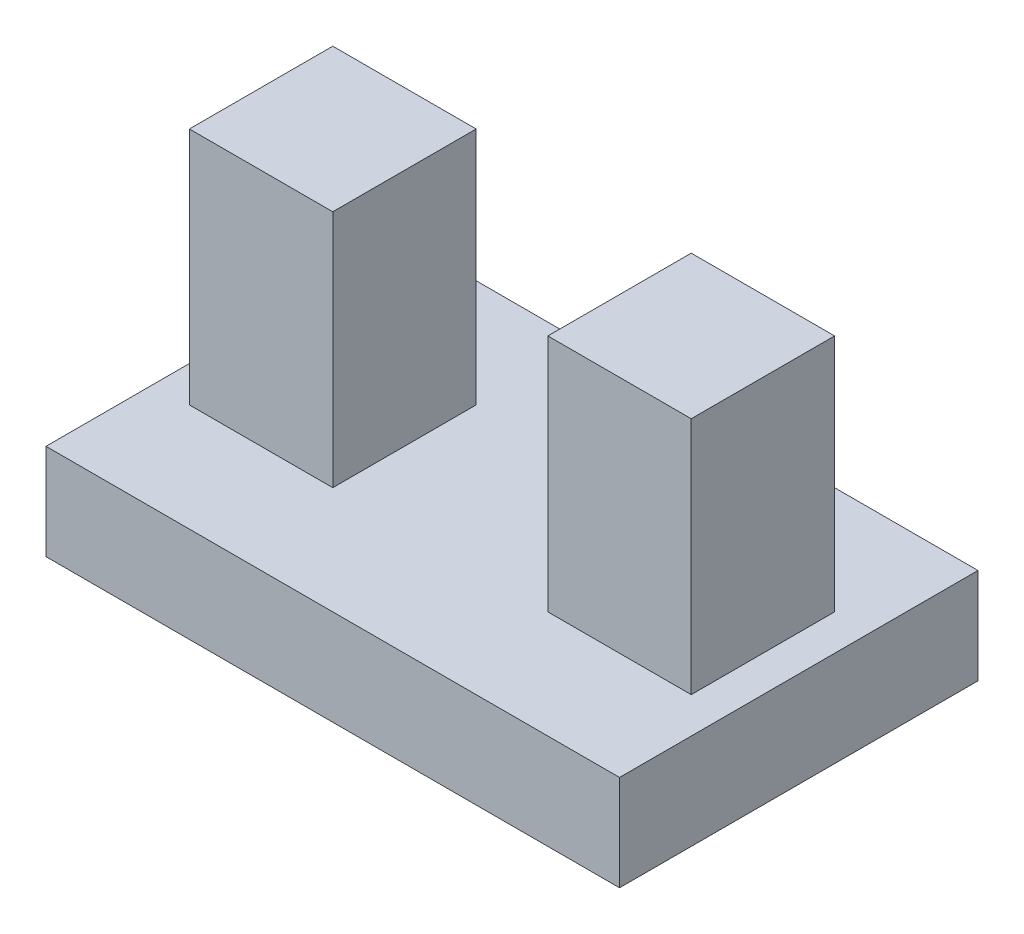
ISO-10303-21;
HEADER;
FILE_DESCRIPTION(('STEP AP214'),'2;1');
FILE_NAME('part.step','',(''),(''),'','','');
FILE_SCHEMA(('AUTOMOTIVE_DESIGN { 1 0 10303 214 1 1 1 1 }'));
ENDSEC;
DATA;
#1=APPLICATION_CONTEXT('core data for automotive mechanical design processes');
#2=APPLICATION_PROTOCOL_DEFINITION('international standard','automotive_design',2000,#1);
#3=PRODUCT_CONTEXT('',#1,'mechanical');
#4=PRODUCT('Part','Part','',(#3));
#5=PRODUCT_RELATED_PRODUCT_CATEGORY('part','',(#4));
#6=PRODUCT_DEFINITION_FORMATION('','',#4);
#7=PRODUCT_DEFINITION_CONTEXT('part definition',#1,'design');
#8=PRODUCT_DEFINITION('design','',#6,#7);
#9=PRODUCT_DEFINITION_SHAPE('','',#8);
#10=(LENGTH_UNIT() NAMED_UNIT(*) SI_UNIT(.MILLI.,.METRE.));
#11=(NAMED_UNIT(*) PLANE_ANGLE_UNIT() SI_UNIT($,.RADIAN.));
#12=(NAMED_UNIT(*) SI_UNIT($,.STERADIAN.) SOLID_ANGLE_UNIT());
#13=UNCERTAINTY_MEASURE_WITH_UNIT(LENGTH_MEASURE(1.E-05),#10,'distance_accuracy_value','');
#14=(GEOMETRIC_REPRESENTATION_CONTEXT(3) GLOBAL_UNCERTAINTY_ASSIGNED_CONTEXT((#13)) GLOBAL_UNIT_ASSIGNED_CONTEXT((#10,
#11,#12)) REPRESENTATION_CONTEXT('',''));
#15=CARTESIAN_POINT('',(0.,0.,0.));
#16=DIRECTION('',(0.,0.,1.));
#17=DIRECTION('',(1.,0.,0.));
#18=AXIS2_PLACEMENT_3D('',#15,#16,#17);
#19=CARTESIAN_POINT('',(0.,4.,0.));
#20=DIRECTION('',(0.,-1.,0.));
#21=DIRECTION('',(0.,0.,-1.));
#22=AXIS2_PLACEMENT_3D('',#19,#20,#21);
#23=PLANE('',#22);
#24=DIRECTION('',(0.,0.,1.));
#25=VECTOR('',#24,1.);
#26=CARTESIAN_POINT('',(-10.5,4.,-3.));
#27=LINE('',#26,#25);
#28=CARTESIAN_POINT('',(-10.5,4.,-3.));
#29=VERTEX_POINT('',#28);
#30=CARTESIAN_POINT('',(-10.5,4.,3.));
#31=VERTEX_POINT('',#30);
#32=EDGE_CURVE('E144',#29,#31,#27,.T.);
#33=ORIENTED_EDGE('',*,*,#32,.F.);
#34=DIRECTION('',(-1.,0.,0.));
#35=VECTOR('',#34,1.);
#36=CARTESIAN_POINT('',(-4.5,4.,-3.));
#37=LINE('',#36,#35);
#38=CARTESIAN_POINT('',(-4.5,4.,-3.));
#39=VERTEX_POINT('',#38);
#40=EDGE_CURVE('E157',#39,#29,#37,.T.);
#41=ORIENTED_EDGE('',*,*,#40,.F.);
#42=DIRECTION('',(0.,0.,-1.));
#43=VECTOR('',#42,1.);
#44=CARTESIAN_POINT('',(-4.5,4.,-3.));
#45=LINE('',#44,#43);
#46=CARTESIAN_POINT('',(-4.5,4.,3.));
#47=VERTEX_POINT('',#46);
#48=EDGE_CURVE('E166',#47,#39,#45,.T.);
#49=ORIENTED_EDGE('',*,*,#48,.F.);
#50=DIRECTION('',(1.,0.,0.));
#51=VECTOR('',#50,1.);
#52=CARTESIAN_POINT('',(-4.5,4.,3.));
#53=LINE('',#52,#51);
#54=EDGE_CURVE('E147',#31,#47,#53,.T.);
#55=ORIENTED_EDGE('',*,*,#54,.F.);
#56=EDGE_LOOP('',(#33,#41,#49,#55));
#57=FACE_BOUND('',#56,.T.);
#58=DIRECTION('',(0.,0.,1.));
#59=VECTOR('',#58,1.);
#60=CARTESIAN_POINT('',(-12.,4.,-7.5));
#61=LINE('',#60,#59);
#62=CARTESIAN_POINT('',(-12.,4.,-7.5));
#63=VERTEX_POINT('',#62);
#64=CARTESIAN_POINT('',(-12.,4.,7.5));
#65=VERTEX_POINT('',#64);
#66=EDGE_CURVE('E183',#63,#65,#61,.T.);
#67=ORIENTED_EDGE('',*,*,#66,.T.);
#68=DIRECTION('',(1.,0.,0.));
#69=VECTOR('',#68,1.);
#70=CARTESIAN_POINT('',(12.,4.,7.5));
#71=LINE('',#70,#69);
#72=CARTESIAN_POINT('',(12.,4.,7.5));
#73=VERTEX_POINT('',#72);
#74=EDGE_CURVE('E186',#65,#73,#71,.T.);
#75=ORIENTED_EDGE('',*,*,#74,.T.);
#76=DIRECTION('',(0.,0.,-1.));
#77=VECTOR('',#76,1.);
#78=CARTESIAN_POINT('',(12.,4.,-7.5));
#79=LINE('',#78,#77);
#80=CARTESIAN_POINT('',(12.,4.,-7.5));
#81=VERTEX_POINT('',#80);
#82=EDGE_CURVE('E189',#73,#81,#79,.T.);
#83=ORIENTED_EDGE('',*,*,#82,.T.);
#84=DIRECTION('',(-1.,0.,0.));
#85=VECTOR('',#84,1.);
#86=CARTESIAN_POINT('',(12.,4.,-7.5));
#87=LINE('',#86,#85);
#88=EDGE_CURVE('E191',#81,#63,#87,.T.);
#89=ORIENTED_EDGE('',*,*,#88,.T.);
#90=EDGE_LOOP('',(#67,#75,#83,#89));
#91=FACE_BOUND('',#90,.T.);
#92=DIRECTION('',(0.,0.,1.));
#93=VECTOR('',#92,1.);
#94=CARTESIAN_POINT('',(4.5,4.,-3.00000000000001));
#95=LINE('',#94,#93);
#96=CARTESIAN_POINT('',(4.5,4.,-3.00000000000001));
#97=VERTEX_POINT('',#96);
#98=CARTESIAN_POINT('',(4.5,4.,2.99999999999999));
#99=VERTEX_POINT('',#98);
#100=EDGE_CURVE('E143',#97,#99,#95,.T.);
#101=ORIENTED_EDGE('',*,*,#100,.F.);
#102=DIRECTION('',(-1.,0.,0.));
#103=VECTOR('',#102,1.);
#104=CARTESIAN_POINT('',(4.5,4.,-3.00000000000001));
#105=LINE('',#104,#103);
#106=CARTESIAN_POINT('',(10.5,4.,-3.00000000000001));
#107=VERTEX_POINT('',#106);
#108=EDGE_CURVE('E140',#107,#97,#105,.T.);
#109=ORIENTED_EDGE('',*,*,#108,.F.);
#110=DIRECTION('',(0.,0.,-1.));
#111=VECTOR('',#110,1.);
#112=CARTESIAN_POINT('',(10.5,4.,-3.00000000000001));
#113=LINE('',#112,#111);
#114=CARTESIAN_POINT('',(10.5,4.,2.99999999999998));
#115=VERTEX_POINT('',#114);
#116=EDGE_CURVE('E54',#115,#107,#113,.T.);
#117=ORIENTED_EDGE('',*,*,#116,.F.);
#118=DIRECTION('',(1.,0.,0.));
#119=VECTOR('',#118,1.);
#120=CARTESIAN_POINT('',(4.5,4.,2.99999999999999));
#121=LINE('',#120,#119);
#122=EDGE_CURVE('E49',#99,#115,#121,.T.);
#123=ORIENTED_EDGE('',*,*,#122,.F.);
#124=EDGE_LOOP('',(#101,#109,#117,#123));
#125=FACE_BOUND('',#124,.T.);
#126=ADVANCED_FACE('F34',(#57,#91,#125),#23,.F.);
#127=CARTESIAN_POINT('',(-12.,4.,-7.5));
#128=DIRECTION('',(1.,0.,0.));
#129=DIRECTION('',(0.,0.,-1.));
#130=AXIS2_PLACEMENT_3D('',#127,#128,#129);
#131=PLANE('',#130);
#132=DIRECTION('',(0.,0.,1.));
#133=VECTOR('',#132,1.);
#134=CARTESIAN_POINT('',(-12.,0.,-7.5));
#135=LINE('',#134,#133);
#136=CARTESIAN_POINT('',(-12.,0.,-7.5));
#137=VERTEX_POINT('',#136);
#138=CARTESIAN_POINT('',(-12.,0.,7.5));
#139=VERTEX_POINT('',#138);
#140=EDGE_CURVE('E182',#137,#139,#135,.T.);
#141=ORIENTED_EDGE('',*,*,#140,.T.);
#142=DIRECTION('',(0.,-1.,0.));
#143=VECTOR('',#142,1.);
#144=CARTESIAN_POINT('',(-12.,4.,7.5));
#145=LINE('',#144,#143);
#146=EDGE_CURVE('E11',#65,#139,#145,.T.);
#147=ORIENTED_EDGE('',*,*,#146,.F.);
#148=ORIENTED_EDGE('',*,*,#66,.F.);
#149=DIRECTION('',(0.,-1.,0.));
#150=VECTOR('',#149,1.);
#151=CARTESIAN_POINT('',(-12.,4.,-7.5));
#152=LINE('',#151,#150);
#153=EDGE_CURVE('E193',#63,#137,#152,.T.);
#154=ORIENTED_EDGE('',*,*,#153,.T.);
#155=EDGE_LOOP('',(#141,#147,#148,#154));
#156=FACE_BOUND('',#155,.T.);
#157=ADVANCED_FACE('F36',(#156),#131,.F.);
#158=CARTESIAN_POINT('',(12.,4.,7.5));
#159=DIRECTION('',(0.,0.,-1.));
#160=DIRECTION('',(-1.,0.,0.));
#161=AXIS2_PLACEMENT_3D('',#158,#159,#160);
#162=PLANE('',#161);
#163=DIRECTION('',(1.,0.,0.));
#164=VECTOR('',#163,1.);
#165=CARTESIAN_POINT('',(12.,0.,7.5));
#166=LINE('',#165,#164);
#167=CARTESIAN_POINT('',(12.,0.,7.5));
#168=VERTEX_POINT('',#167);
#169=EDGE_CURVE('E196',#139,#168,#166,.T.);
#170=ORIENTED_EDGE('',*,*,#169,.T.);
#171=DIRECTION('',(0.,-1.,0.));
#172=VECTOR('',#171,1.);
#173=CARTESIAN_POINT('',(12.,4.,7.5));
#174=LINE('',#173,#172);
#175=EDGE_CURVE('E42',#73,#168,#174,.T.);
#176=ORIENTED_EDGE('',*,*,#175,.F.);
#177=ORIENTED_EDGE('',*,*,#74,.F.);
#178=ORIENTED_EDGE('',*,*,#146,.T.);
#179=EDGE_LOOP('',(#170,#176,#177,#178));
#180=FACE_BOUND('',#179,.T.);
#181=ADVANCED_FACE('F225',(#180),#162,.F.);
#182=CARTESIAN_POINT('',(12.,4.,-7.5));
#183=DIRECTION('',(-1.,0.,0.));
#184=DIRECTION('',(0.,0.,1.));
#185=AXIS2_PLACEMENT_3D('',#182,#183,#184);
#186=PLANE('',#185);
#187=DIRECTION('',(0.,0.,-1.));
#188=VECTOR('',#187,1.);
#189=CARTESIAN_POINT('',(12.,0.,-7.5));
#190=LINE('',#189,#188);
#191=CARTESIAN_POINT('',(12.,0.,-7.5));
#192=VERTEX_POINT('',#191);
#193=EDGE_CURVE('E198',#168,#192,#190,.T.);
#194=ORIENTED_EDGE('',*,*,#193,.T.);
#195=DIRECTION('',(0.,-1.,0.));
#196=VECTOR('',#195,1.);
#197=CARTESIAN_POINT('',(12.,4.,-7.5));
#198=LINE('',#197,#196);
#199=EDGE_CURVE('E203',#81,#192,#198,.T.);
#200=ORIENTED_EDGE('',*,*,#199,.F.);
#201=ORIENTED_EDGE('',*,*,#82,.F.);
#202=ORIENTED_EDGE('',*,*,#175,.T.);
#203=EDGE_LOOP('',(#194,#200,#201,#202));
#204=FACE_BOUND('',#203,.T.);
#205=ADVANCED_FACE('F210',(#204),#186,.F.);
#206=CARTESIAN_POINT('',(12.,4.,-7.5));
#207=DIRECTION('',(0.,0.,1.));
#208=DIRECTION('',(1.,0.,0.));
#209=AXIS2_PLACEMENT_3D('',#206,#207,#208);
#210=PLANE('',#209);
#211=DIRECTION('',(-1.,0.,0.));
#212=VECTOR('',#211,1.);
#213=CARTESIAN_POINT('',(12.,0.,-7.5));
#214=LINE('',#213,#212);
#215=EDGE_CURVE('E187',#192,#137,#214,.T.);
#216=ORIENTED_EDGE('',*,*,#215,.T.);
#217=ORIENTED_EDGE('',*,*,#153,.F.);
#218=ORIENTED_EDGE('',*,*,#88,.F.);
#219=ORIENTED_EDGE('',*,*,#199,.T.);
#220=EDGE_LOOP('',(#216,#217,#218,#219));
#221=FACE_BOUND('',#220,.T.);
#222=ADVANCED_FACE('F219',(#221),#210,.F.);
#223=CARTESIAN_POINT('',(0.,0.,0.));
#224=DIRECTION('',(0.,-1.,0.));
#225=DIRECTION('',(0.,0.,-1.));
#226=AXIS2_PLACEMENT_3D('',#223,#224,#225);
#227=PLANE('',#226);
#228=ORIENTED_EDGE('',*,*,#140,.F.);
#229=ORIENTED_EDGE('',*,*,#215,.F.);
#230=ORIENTED_EDGE('',*,*,#193,.F.);
#231=ORIENTED_EDGE('',*,*,#169,.F.);
#232=EDGE_LOOP('',(#228,#229,#230,#231));
#233=FACE_BOUND('',#232,.T.);
#234=ADVANCED_FACE('F216',(#233),#227,.T.);
#235=CARTESIAN_POINT('',(-10.5,14.,-3.));
#236=DIRECTION('',(1.,0.,0.));
#237=DIRECTION('',(0.,0.,-1.));
#238=AXIS2_PLACEMENT_3D('',#235,#236,#237);
#239=PLANE('',#238);
#240=ORIENTED_EDGE('',*,*,#32,.T.);
#241=DIRECTION('',(0.,-1.,0.));
#242=VECTOR('',#241,1.);
#243=CARTESIAN_POINT('',(-10.5,14.,3.));
#244=LINE('',#243,#242);
#245=CARTESIAN_POINT('',(-10.5,14.,3.));
#246=VERTEX_POINT('',#245);
#247=EDGE_CURVE('E179',#246,#31,#244,.T.);
#248=ORIENTED_EDGE('',*,*,#247,.F.);
#249=DIRECTION('',(0.,0.,1.));
#250=VECTOR('',#249,1.);
#251=CARTESIAN_POINT('',(-10.5,14.,-3.));
#252=LINE('',#251,#250);
#253=CARTESIAN_POINT('',(-10.5,14.,-3.));
#254=VERTEX_POINT('',#253);
#255=EDGE_CURVE('E153',#254,#246,#252,.T.);
#256=ORIENTED_EDGE('',*,*,#255,.F.);
#257=DIRECTION('',(0.,-1.,0.));
#258=VECTOR('',#257,1.);
#259=CARTESIAN_POINT('',(-10.5,14.,-3.));
#260=LINE('',#259,#258);
#261=EDGE_CURVE('E162',#254,#29,#260,.T.);
#262=ORIENTED_EDGE('',*,*,#261,.T.);
#263=EDGE_LOOP('',(#240,#248,#256,#262));
#264=FACE_BOUND('',#263,.T.);
#265=ADVANCED_FACE('F239',(#264),#239,.F.);
#266=CARTESIAN_POINT('',(-4.5,14.,3.));
#267=DIRECTION('',(0.,0.,-1.));
#268=DIRECTION('',(-1.,0.,0.));
#269=AXIS2_PLACEMENT_3D('',#266,#267,#268);
#270=PLANE('',#269);
#271=ORIENTED_EDGE('',*,*,#54,.T.);
#272=DIRECTION('',(0.,-1.,0.));
#273=VECTOR('',#272,1.);
#274=CARTESIAN_POINT('',(-4.5,14.,3.));
#275=LINE('',#274,#273);
#276=CARTESIAN_POINT('',(-4.5,14.,3.));
#277=VERTEX_POINT('',#276);
#278=EDGE_CURVE('E176',#277,#47,#275,.T.);
#279=ORIENTED_EDGE('',*,*,#278,.F.);
#280=DIRECTION('',(1.,0.,0.));
#281=VECTOR('',#280,1.);
#282=CARTESIAN_POINT('',(-4.5,14.,3.));
#283=LINE('',#282,#281);
#284=EDGE_CURVE('E156',#246,#277,#283,.T.);
#285=ORIENTED_EDGE('',*,*,#284,.F.);
#286=ORIENTED_EDGE('',*,*,#247,.T.);
#287=EDGE_LOOP('',(#271,#279,#285,#286));
#288=FACE_BOUND('',#287,.T.);
#289=ADVANCED_FACE('F258',(#288),#270,.F.);
#290=CARTESIAN_POINT('',(-4.5,14.,-3.));
#291=DIRECTION('',(-1.,0.,0.));
#292=DIRECTION('',(0.,0.,1.));
#293=AXIS2_PLACEMENT_3D('',#290,#291,#292);
#294=PLANE('',#293);
#295=ORIENTED_EDGE('',*,*,#48,.T.);
#296=DIRECTION('',(0.,-1.,0.));
#297=VECTOR('',#296,1.);
#298=CARTESIAN_POINT('',(-4.5,14.,-3.));
#299=LINE('',#298,#297);
#300=CARTESIAN_POINT('',(-4.5,14.,-3.));
#301=VERTEX_POINT('',#300);
#302=EDGE_CURVE('E173',#301,#39,#299,.T.);
#303=ORIENTED_EDGE('',*,*,#302,.F.);
#304=DIRECTION('',(0.,0.,-1.));
#305=VECTOR('',#304,1.);
#306=CARTESIAN_POINT('',(-4.5,14.,-3.));
#307=LINE('',#306,#305);
#308=EDGE_CURVE('E159',#277,#301,#307,.T.);
#309=ORIENTED_EDGE('',*,*,#308,.F.);
#310=ORIENTED_EDGE('',*,*,#278,.T.);
#311=EDGE_LOOP('',(#295,#303,#309,#310));
#312=FACE_BOUND('',#311,.T.);
#313=ADVANCED_FACE('F265',(#312),#294,.F.);
#314=CARTESIAN_POINT('',(-4.5,14.,-3.));
#315=DIRECTION('',(0.,0.,1.));
#316=DIRECTION('',(1.,0.,0.));
#317=AXIS2_PLACEMENT_3D('',#314,#315,#316);
#318=PLANE('',#317);
#319=ORIENTED_EDGE('',*,*,#40,.T.);
#320=ORIENTED_EDGE('',*,*,#261,.F.);
#321=DIRECTION('',(-1.,0.,0.));
#322=VECTOR('',#321,1.);
#323=CARTESIAN_POINT('',(-4.5,14.,-3.));
#324=LINE('',#323,#322);
#325=EDGE_CURVE('E161',#301,#254,#324,.T.);
#326=ORIENTED_EDGE('',*,*,#325,.F.);
#327=ORIENTED_EDGE('',*,*,#302,.T.);
#328=EDGE_LOOP('',(#319,#320,#326,#327));
#329=FACE_BOUND('',#328,.T.);
#330=ADVANCED_FACE('F272',(#329),#318,.F.);
#331=CARTESIAN_POINT('',(0.,14.,0.));
#332=DIRECTION('',(0.,-1.,0.));
#333=DIRECTION('',(0.,0.,-1.));
#334=AXIS2_PLACEMENT_3D('',#331,#332,#333);
#335=PLANE('',#334);
#336=ORIENTED_EDGE('',*,*,#255,.T.);
#337=ORIENTED_EDGE('',*,*,#284,.T.);
#338=ORIENTED_EDGE('',*,*,#308,.T.);
#339=ORIENTED_EDGE('',*,*,#325,.T.);
#340=EDGE_LOOP('',(#336,#337,#338,#339));
#341=FACE_BOUND('',#340,.T.);
#342=ADVANCED_FACE('F280',(#341),#335,.F.);
#343=CARTESIAN_POINT('',(4.5,14.,-3.00000000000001));
#344=DIRECTION('',(1.,0.,0.));
#345=DIRECTION('',(0.,0.,-1.));
#346=AXIS2_PLACEMENT_3D('',#343,#344,#345);
#347=PLANE('',#346);
#348=ORIENTED_EDGE('',*,*,#100,.T.);
#349=DIRECTION('',(0.,-1.,0.));
#350=VECTOR('',#349,1.);
#351=CARTESIAN_POINT('',(4.5,14.,2.99999999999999));
#352=LINE('',#351,#350);
#353=CARTESIAN_POINT('',(4.5,14.,2.99999999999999));
#354=VERTEX_POINT('',#353);
#355=EDGE_CURVE('E124',#354,#99,#352,.T.);
#356=ORIENTED_EDGE('',*,*,#355,.F.);
#357=DIRECTION('',(0.,0.,1.));
#358=VECTOR('',#357,1.);
#359=CARTESIAN_POINT('',(4.5,14.,-3.00000000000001));
#360=LINE('',#359,#358);
#361=CARTESIAN_POINT('',(4.5,14.,-3.00000000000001));
#362=VERTEX_POINT('',#361);
#363=EDGE_CURVE('E131',#362,#354,#360,.T.);
#364=ORIENTED_EDGE('',*,*,#363,.F.);
#365=DIRECTION('',(0.,-1.,0.));
#366=VECTOR('',#365,1.);
#367=CARTESIAN_POINT('',(4.5,14.,-3.00000000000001));
#368=LINE('',#367,#366);
#369=EDGE_CURVE('E369',#362,#97,#368,.T.);
#370=ORIENTED_EDGE('',*,*,#369,.T.);
#371=EDGE_LOOP('',(#348,#356,#364,#370));
#372=FACE_BOUND('',#371,.T.);
#373=ADVANCED_FACE('F142',(#372),#347,.F.);
#374=CARTESIAN_POINT('',(4.5,14.,2.99999999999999));
#375=DIRECTION('',(0.,0.,-1.));
#376=DIRECTION('',(-1.,0.,0.));
#377=AXIS2_PLACEMENT_3D('',#374,#375,#376);
#378=PLANE('',#377);
#379=ORIENTED_EDGE('',*,*,#122,.T.);
#380=DIRECTION('',(0.,-1.,0.));
#381=VECTOR('',#380,1.);
#382=CARTESIAN_POINT('',(10.5,14.,2.99999999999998));
#383=LINE('',#382,#381);
#384=CARTESIAN_POINT('',(10.5,14.,2.99999999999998));
#385=VERTEX_POINT('',#384);
#386=EDGE_CURVE('E127',#385,#115,#383,.T.);
#387=ORIENTED_EDGE('',*,*,#386,.F.);
#388=DIRECTION('',(1.,0.,0.));
#389=VECTOR('',#388,1.);
#390=CARTESIAN_POINT('',(4.5,14.,2.99999999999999));
#391=LINE('',#390,#389);
#392=EDGE_CURVE('E120',#354,#385,#391,.T.);
#393=ORIENTED_EDGE('',*,*,#392,.F.);
#394=ORIENTED_EDGE('',*,*,#355,.T.);
#395=EDGE_LOOP('',(#379,#387,#393,#394));
#396=FACE_BOUND('',#395,.T.);
#397=ADVANCED_FACE('F122',(#396),#378,.F.);
#398=CARTESIAN_POINT('',(10.5,14.,-3.00000000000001));
#399=DIRECTION('',(-1.,0.,0.));
#400=DIRECTION('',(0.,0.,1.));
#401=AXIS2_PLACEMENT_3D('',#398,#399,#400);
#402=PLANE('',#401);
#403=ORIENTED_EDGE('',*,*,#116,.T.);
#404=DIRECTION('',(0.,-1.,0.));
#405=VECTOR('',#404,1.);
#406=CARTESIAN_POINT('',(10.5,14.,-3.00000000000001));
#407=LINE('',#406,#405);
#408=CARTESIAN_POINT('',(10.5,14.,-3.00000000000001));
#409=VERTEX_POINT('',#408);
#410=EDGE_CURVE('E149',#409,#107,#407,.T.);
#411=ORIENTED_EDGE('',*,*,#410,.F.);
#412=DIRECTION('',(0.,0.,-1.));
#413=VECTOR('',#412,1.);
#414=CARTESIAN_POINT('',(10.5,14.,-3.00000000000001));
#415=LINE('',#414,#413);
#416=EDGE_CURVE('E130',#385,#409,#415,.T.);
#417=ORIENTED_EDGE('',*,*,#416,.F.);
#418=ORIENTED_EDGE('',*,*,#386,.T.);
#419=EDGE_LOOP('',(#403,#411,#417,#418));
#420=FACE_BOUND('',#419,.T.);
#421=ADVANCED_FACE('F301',(#420),#402,.F.);
#422=CARTESIAN_POINT('',(4.5,14.,-3.00000000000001));
#423=DIRECTION('',(0.,0.,1.));
#424=DIRECTION('',(1.,0.,0.));
#425=AXIS2_PLACEMENT_3D('',#422,#423,#424);
#426=PLANE('',#425);
#427=ORIENTED_EDGE('',*,*,#108,.T.);
#428=ORIENTED_EDGE('',*,*,#369,.F.);
#429=DIRECTION('',(-1.,0.,0.));
#430=VECTOR('',#429,1.);
#431=CARTESIAN_POINT('',(4.5,14.,-3.00000000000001));
#432=LINE('',#431,#430);
#433=EDGE_CURVE('E136',#409,#362,#432,.T.);
#434=ORIENTED_EDGE('',*,*,#433,.F.);
#435=ORIENTED_EDGE('',*,*,#410,.T.);
#436=EDGE_LOOP('',(#427,#428,#434,#435));
#437=FACE_BOUND('',#436,.T.);
#438=ADVANCED_FACE('F308',(#437),#426,.F.);
#439=CARTESIAN_POINT('',(0.,14.,0.));
#440=DIRECTION('',(0.,1.,0.));
#441=DIRECTION('',(0.,0.,1.));
#442=AXIS2_PLACEMENT_3D('',#439,#440,#441);
#443=PLANE('',#442);
#444=ORIENTED_EDGE('',*,*,#363,.T.);
#445=ORIENTED_EDGE('',*,*,#392,.T.);
#446=ORIENTED_EDGE('',*,*,#416,.T.);
#447=ORIENTED_EDGE('',*,*,#433,.T.);
#448=EDGE_LOOP('',(#444,#445,#446,#447));
#449=FACE_BOUND('',#448,.T.);
#450=ADVANCED_FACE('F134',(#449),#443,.T.);
#451=CLOSED_SHELL('',(#126,#157,#181,#205,#222,#234,#265,#289,#313,#330,#342,#373,#397,#421,
#438,#450));
#452=MANIFOLD_SOLID_BREP('B2',#451);
#453=ADVANCED_BREP_SHAPE_REPRESENTATION('',(#18,#452),#14);
#454=SHAPE_DEFINITION_REPRESENTATION(#9,#453);
ENDSEC;
END-ISO-10303-21;
